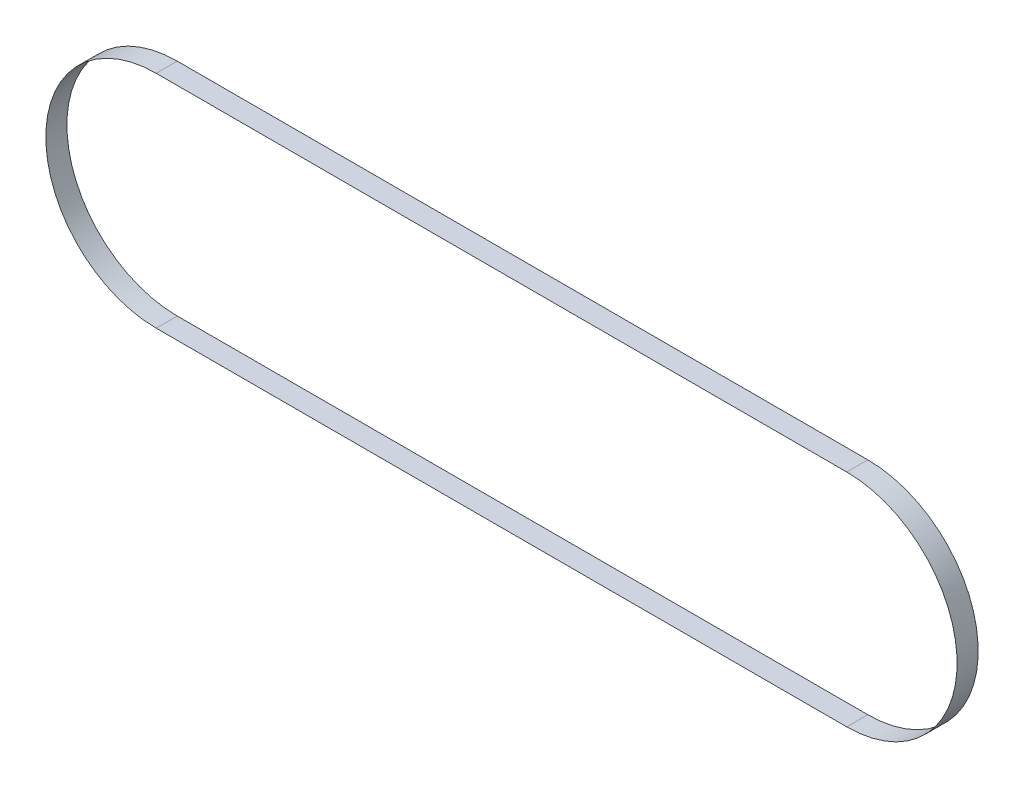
ISO-10303-21;
HEADER;
FILE_DESCRIPTION(('STEP AP214'),'2;1');
FILE_NAME('part.step','',(''),(''),'','','');
FILE_SCHEMA(('AUTOMOTIVE_DESIGN { 1 0 10303 214 1 1 1 1 }'));
ENDSEC;
DATA;
#1=APPLICATION_CONTEXT('core data for automotive mechanical design processes');
#2=APPLICATION_PROTOCOL_DEFINITION('international standard','automotive_design',2000,#1);
#3=PRODUCT_CONTEXT('',#1,'mechanical');
#4=PRODUCT('Part','Part','',(#3));
#5=PRODUCT_RELATED_PRODUCT_CATEGORY('part','',(#4));
#6=PRODUCT_DEFINITION_FORMATION('','',#4);
#7=PRODUCT_DEFINITION_CONTEXT('part definition',#1,'design');
#8=PRODUCT_DEFINITION('design','',#6,#7);
#9=PRODUCT_DEFINITION_SHAPE('','',#8);
#10=(LENGTH_UNIT() NAMED_UNIT(*) SI_UNIT(.MILLI.,.METRE.));
#11=(NAMED_UNIT(*) PLANE_ANGLE_UNIT() SI_UNIT($,.RADIAN.));
#12=(NAMED_UNIT(*) SI_UNIT($,.STERADIAN.) SOLID_ANGLE_UNIT());
#13=UNCERTAINTY_MEASURE_WITH_UNIT(LENGTH_MEASURE(1.E-05),#10,'distance_accuracy_value','');
#14=(GEOMETRIC_REPRESENTATION_CONTEXT(3) GLOBAL_UNCERTAINTY_ASSIGNED_CONTEXT((#13)) GLOBAL_UNIT_ASSIGNED_CONTEXT((#10,
#11,#12)) REPRESENTATION_CONTEXT('',''));
#15=CARTESIAN_POINT('',(0.,0.,0.));
#16=DIRECTION('',(0.,0.,1.));
#17=DIRECTION('',(1.,0.,0.));
#18=AXIS2_PLACEMENT_3D('',#15,#16,#17);
#19=CARTESIAN_POINT('',(253.982046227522,0.,3.875));
#20=DIRECTION('',(0.,0.,-1.));
#21=DIRECTION('',(-1.,0.,0.));
#22=AXIS2_PLACEMENT_3D('',#19,#20,#21);
#23=PLANE('',#22);
#24=CARTESIAN_POINT('',(253.982046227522,0.,3.875));
#25=DIRECTION('',(0.,0.,-1.));
#26=DIRECTION('',(-1.,0.,0.));
#27=AXIS2_PLACEMENT_3D('',#24,#25,#26);
#28=CIRCLE('',#27,40.59505);
#29=CARTESIAN_POINT('',(253.982046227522,-40.59505,3.875));
#30=VERTEX_POINT('',#29);
#31=CARTESIAN_POINT('',(253.982046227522,40.59505,3.875));
#32=VERTEX_POINT('',#31);
#33=EDGE_CURVE('E158',#30,#32,#28,.F.);
#34=ORIENTED_EDGE('',*,*,#33,.T.);
#35=DIRECTION('',(-1.,0.,0.));
#36=VECTOR('',#35,1.);
#37=CARTESIAN_POINT('',(253.982046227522,40.59505,3.875));
#38=LINE('',#37,#36);
#39=CARTESIAN_POINT('',(0.,40.59505,3.875));
#40=VERTEX_POINT('',#39);
#41=EDGE_CURVE('E161',#32,#40,#38,.T.);
#42=ORIENTED_EDGE('',*,*,#41,.T.);
#43=CARTESIAN_POINT('',(0.,0.,3.875));
#44=DIRECTION('',(0.,0.,-1.));
#45=DIRECTION('',(-1.,0.,0.));
#46=AXIS2_PLACEMENT_3D('',#43,#44,#45);
#47=CIRCLE('',#46,40.59505);
#48=CARTESIAN_POINT('',(0.,-40.59505,3.875));
#49=VERTEX_POINT('',#48);
#50=EDGE_CURVE('E164',#40,#49,#47,.F.);
#51=ORIENTED_EDGE('',*,*,#50,.T.);
#52=DIRECTION('',(1.,0.,0.));
#53=VECTOR('',#52,1.);
#54=CARTESIAN_POINT('',(253.982046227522,-40.59505,3.875));
#55=LINE('',#54,#53);
#56=EDGE_CURVE('E166',#49,#30,#55,.T.);
#57=ORIENTED_EDGE('',*,*,#56,.T.);
#58=EDGE_LOOP('',(#34,#42,#51,#57));
#59=FACE_BOUND('',#58,.T.);
#60=CARTESIAN_POINT('',(253.982046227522,0.,3.875));
#61=DIRECTION('',(0.,0.,-1.));
#62=DIRECTION('',(-1.,0.,0.));
#63=AXIS2_PLACEMENT_3D('',#60,#61,#62);
#64=CIRCLE('',#63,40.59495);
#65=CARTESIAN_POINT('',(253.982046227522,-40.59495,3.875));
#66=VERTEX_POINT('',#65);
#67=CARTESIAN_POINT('',(253.982046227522,40.59495,3.875));
#68=VERTEX_POINT('',#67);
#69=EDGE_CURVE('E122',#66,#68,#64,.F.);
#70=ORIENTED_EDGE('',*,*,#69,.F.);
#71=DIRECTION('',(1.,0.,0.));
#72=VECTOR('',#71,1.);
#73=CARTESIAN_POINT('',(253.982046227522,-40.59495,3.875));
#74=LINE('',#73,#72);
#75=CARTESIAN_POINT('',(0.,-40.59495,3.875));
#76=VERTEX_POINT('',#75);
#77=EDGE_CURVE('E144',#76,#66,#74,.T.);
#78=ORIENTED_EDGE('',*,*,#77,.F.);
#79=CARTESIAN_POINT('',(0.,0.,3.875));
#80=DIRECTION('',(0.,0.,-1.));
#81=DIRECTION('',(-1.,0.,0.));
#82=AXIS2_PLACEMENT_3D('',#79,#80,#81);
#83=CIRCLE('',#82,40.59495);
#84=CARTESIAN_POINT('',(0.,40.59495,3.875));
#85=VERTEX_POINT('',#84);
#86=EDGE_CURVE('E142',#85,#76,#83,.F.);
#87=ORIENTED_EDGE('',*,*,#86,.F.);
#88=DIRECTION('',(-1.,0.,0.));
#89=VECTOR('',#88,1.);
#90=CARTESIAN_POINT('',(253.982046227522,40.59495,3.875));
#91=LINE('',#90,#89);
#92=EDGE_CURVE('E130',#68,#85,#91,.T.);
#93=ORIENTED_EDGE('',*,*,#92,.F.);
#94=EDGE_LOOP('',(#70,#78,#87,#93));
#95=FACE_BOUND('',#94,.T.);
#96=ADVANCED_FACE('F57',(#59,#95),#23,.F.);
#97=CARTESIAN_POINT('',(253.982046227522,0.,-3.875));
#98=DIRECTION('',(0.,0.,-1.));
#99=DIRECTION('',(-1.,0.,0.));
#100=AXIS2_PLACEMENT_3D('',#97,#98,#99);
#101=PLANE('',#100);
#102=CARTESIAN_POINT('',(253.982046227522,0.,-3.875));
#103=DIRECTION('',(0.,0.,-1.));
#104=DIRECTION('',(-1.,0.,0.));
#105=AXIS2_PLACEMENT_3D('',#102,#103,#104);
#106=CIRCLE('',#105,40.59505);
#107=CARTESIAN_POINT('',(253.982046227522,-40.59505,-3.875));
#108=VERTEX_POINT('',#107);
#109=CARTESIAN_POINT('',(253.982046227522,40.59505,-3.875));
#110=VERTEX_POINT('',#109);
#111=EDGE_CURVE('E138',#108,#110,#106,.F.);
#112=ORIENTED_EDGE('',*,*,#111,.F.);
#113=DIRECTION('',(1.,0.,0.));
#114=VECTOR('',#113,1.);
#115=CARTESIAN_POINT('',(253.982046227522,-40.59505,-3.875));
#116=LINE('',#115,#114);
#117=CARTESIAN_POINT('',(0.,-40.59505,-3.875));
#118=VERTEX_POINT('',#117);
#119=EDGE_CURVE('E162',#118,#108,#116,.T.);
#120=ORIENTED_EDGE('',*,*,#119,.F.);
#121=CARTESIAN_POINT('',(0.,0.,-3.875));
#122=DIRECTION('',(0.,0.,-1.));
#123=DIRECTION('',(-1.,0.,0.));
#124=AXIS2_PLACEMENT_3D('',#121,#122,#123);
#125=CIRCLE('',#124,40.59505);
#126=CARTESIAN_POINT('',(0.,40.59505,-3.875));
#127=VERTEX_POINT('',#126);
#128=EDGE_CURVE('E173',#127,#118,#125,.F.);
#129=ORIENTED_EDGE('',*,*,#128,.F.);
#130=DIRECTION('',(-1.,0.,0.));
#131=VECTOR('',#130,1.);
#132=CARTESIAN_POINT('',(253.982046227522,40.59505,-3.875));
#133=LINE('',#132,#131);
#134=EDGE_CURVE('E171',#110,#127,#133,.T.);
#135=ORIENTED_EDGE('',*,*,#134,.F.);
#136=EDGE_LOOP('',(#112,#120,#129,#135));
#137=FACE_BOUND('',#136,.T.);
#138=DIRECTION('',(1.,0.,0.));
#139=VECTOR('',#138,1.);
#140=CARTESIAN_POINT('',(253.982046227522,-40.59495,-3.875));
#141=LINE('',#140,#139);
#142=CARTESIAN_POINT('',(0.,-40.59495,-3.875));
#143=VERTEX_POINT('',#142);
#144=CARTESIAN_POINT('',(253.982046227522,-40.59495,-3.875));
#145=VERTEX_POINT('',#144);
#146=EDGE_CURVE('E131',#143,#145,#141,.T.);
#147=ORIENTED_EDGE('',*,*,#146,.T.);
#148=CARTESIAN_POINT('',(253.982046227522,0.,-3.875));
#149=DIRECTION('',(0.,0.,-1.));
#150=DIRECTION('',(-1.,0.,0.));
#151=AXIS2_PLACEMENT_3D('',#148,#149,#150);
#152=CIRCLE('',#151,40.59495);
#153=CARTESIAN_POINT('',(253.982046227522,40.59495,-3.875));
#154=VERTEX_POINT('',#153);
#155=EDGE_CURVE('E80',#145,#154,#152,.F.);
#156=ORIENTED_EDGE('',*,*,#155,.T.);
#157=DIRECTION('',(-1.,0.,0.));
#158=VECTOR('',#157,1.);
#159=CARTESIAN_POINT('',(253.982046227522,40.59495,-3.875));
#160=LINE('',#159,#158);
#161=CARTESIAN_POINT('',(0.,40.59495,-3.875));
#162=VERTEX_POINT('',#161);
#163=EDGE_CURVE('E137',#154,#162,#160,.T.);
#164=ORIENTED_EDGE('',*,*,#163,.T.);
#165=CARTESIAN_POINT('',(0.,0.,-3.875));
#166=DIRECTION('',(0.,0.,-1.));
#167=DIRECTION('',(-1.,0.,0.));
#168=AXIS2_PLACEMENT_3D('',#165,#166,#167);
#169=CIRCLE('',#168,40.59495);
#170=EDGE_CURVE('E150',#162,#143,#169,.F.);
#171=ORIENTED_EDGE('',*,*,#170,.T.);
#172=EDGE_LOOP('',(#147,#156,#164,#171));
#173=FACE_BOUND('',#172,.T.);
#174=ADVANCED_FACE('F191',(#137,#173),#101,.T.);
#175=CARTESIAN_POINT('',(253.982046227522,0.,3.875));
#176=DIRECTION('',(0.,0.,-1.));
#177=DIRECTION('',(-1.,0.,0.));
#178=AXIS2_PLACEMENT_3D('',#175,#176,#177);
#179=CYLINDRICAL_SURFACE('',#178,40.59505);
#180=ORIENTED_EDGE('',*,*,#111,.T.);
#181=DIRECTION('',(0.,0.,-1.));
#182=VECTOR('',#181,1.);
#183=CARTESIAN_POINT('',(253.982046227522,40.59505,3.875));
#184=LINE('',#183,#182);
#185=EDGE_CURVE('E12',#32,#110,#184,.T.);
#186=ORIENTED_EDGE('',*,*,#185,.F.);
#187=ORIENTED_EDGE('',*,*,#33,.F.);
#188=DIRECTION('',(0.,0.,-1.));
#189=VECTOR('',#188,1.);
#190=CARTESIAN_POINT('',(253.982046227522,-40.59505,3.875));
#191=LINE('',#190,#189);
#192=EDGE_CURVE('E168',#30,#108,#191,.T.);
#193=ORIENTED_EDGE('',*,*,#192,.T.);
#194=EDGE_LOOP('',(#180,#186,#187,#193));
#195=FACE_BOUND('',#194,.T.);
#196=ADVANCED_FACE('F59',(#195),#179,.T.);
#197=CARTESIAN_POINT('',(253.982046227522,40.59505,3.875));
#198=DIRECTION('',(0.,-1.,0.));
#199=DIRECTION('',(1.,0.,0.));
#200=AXIS2_PLACEMENT_3D('',#197,#198,#199);
#201=PLANE('',#200);
#202=ORIENTED_EDGE('',*,*,#134,.T.);
#203=DIRECTION('',(0.,0.,-1.));
#204=VECTOR('',#203,1.);
#205=CARTESIAN_POINT('',(0.,40.59505,3.875));
#206=LINE('',#205,#204);
#207=EDGE_CURVE('E65',#40,#127,#206,.T.);
#208=ORIENTED_EDGE('',*,*,#207,.F.);
#209=ORIENTED_EDGE('',*,*,#41,.F.);
#210=ORIENTED_EDGE('',*,*,#185,.T.);
#211=EDGE_LOOP('',(#202,#208,#209,#210));
#212=FACE_BOUND('',#211,.T.);
#213=ADVANCED_FACE('F201',(#212),#201,.F.);
#214=CARTESIAN_POINT('',(0.,0.,3.875));
#215=DIRECTION('',(0.,0.,-1.));
#216=DIRECTION('',(-1.,0.,0.));
#217=AXIS2_PLACEMENT_3D('',#214,#215,#216);
#218=CYLINDRICAL_SURFACE('',#217,40.59505);
#219=ORIENTED_EDGE('',*,*,#128,.T.);
#220=DIRECTION('',(0.,0.,-1.));
#221=VECTOR('',#220,1.);
#222=CARTESIAN_POINT('',(0.,-40.59505,3.875));
#223=LINE('',#222,#221);
#224=EDGE_CURVE('E178',#49,#118,#223,.T.);
#225=ORIENTED_EDGE('',*,*,#224,.F.);
#226=ORIENTED_EDGE('',*,*,#50,.F.);
#227=ORIENTED_EDGE('',*,*,#207,.T.);
#228=EDGE_LOOP('',(#219,#225,#226,#227));
#229=FACE_BOUND('',#228,.T.);
#230=ADVANCED_FACE('F185',(#229),#218,.T.);
#231=CARTESIAN_POINT('',(253.982046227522,-40.59505,3.875));
#232=DIRECTION('',(0.,1.,0.));
#233=DIRECTION('',(-1.,0.,0.));
#234=AXIS2_PLACEMENT_3D('',#231,#232,#233);
#235=PLANE('',#234);
#236=ORIENTED_EDGE('',*,*,#119,.T.);
#237=ORIENTED_EDGE('',*,*,#192,.F.);
#238=ORIENTED_EDGE('',*,*,#56,.F.);
#239=ORIENTED_EDGE('',*,*,#224,.T.);
#240=EDGE_LOOP('',(#236,#237,#238,#239));
#241=FACE_BOUND('',#240,.T.);
#242=ADVANCED_FACE('F195',(#241),#235,.F.);
#243=CARTESIAN_POINT('',(253.982046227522,0.,3.875));
#244=DIRECTION('',(0.,0.,-1.));
#245=DIRECTION('',(-1.,0.,0.));
#246=AXIS2_PLACEMENT_3D('',#243,#244,#245);
#247=CYLINDRICAL_SURFACE('',#246,40.59495);
#248=ORIENTED_EDGE('',*,*,#155,.F.);
#249=DIRECTION('',(0.,0.,-1.));
#250=VECTOR('',#249,1.);
#251=CARTESIAN_POINT('',(253.982046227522,-40.59495,3.875));
#252=LINE('',#251,#250);
#253=EDGE_CURVE('E126',#66,#145,#252,.T.);
#254=ORIENTED_EDGE('',*,*,#253,.F.);
#255=ORIENTED_EDGE('',*,*,#69,.T.);
#256=DIRECTION('',(0.,0.,-1.));
#257=VECTOR('',#256,1.);
#258=CARTESIAN_POINT('',(253.982046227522,40.59495,3.875));
#259=LINE('',#258,#257);
#260=EDGE_CURVE('E125',#68,#154,#259,.T.);
#261=ORIENTED_EDGE('',*,*,#260,.T.);
#262=EDGE_LOOP('',(#248,#254,#255,#261));
#263=FACE_BOUND('',#262,.T.);
#264=ADVANCED_FACE('F124',(#263),#247,.F.);
#265=CARTESIAN_POINT('',(253.982046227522,40.59495,3.875));
#266=DIRECTION('',(0.,-1.,0.));
#267=DIRECTION('',(1.,0.,0.));
#268=AXIS2_PLACEMENT_3D('',#265,#266,#267);
#269=PLANE('',#268);
#270=ORIENTED_EDGE('',*,*,#163,.F.);
#271=ORIENTED_EDGE('',*,*,#260,.F.);
#272=ORIENTED_EDGE('',*,*,#92,.T.);
#273=DIRECTION('',(0.,0.,-1.));
#274=VECTOR('',#273,1.);
#275=CARTESIAN_POINT('',(0.,40.59495,3.875));
#276=LINE('',#275,#274);
#277=EDGE_CURVE('E139',#85,#162,#276,.T.);
#278=ORIENTED_EDGE('',*,*,#277,.T.);
#279=EDGE_LOOP('',(#270,#271,#272,#278));
#280=FACE_BOUND('',#279,.T.);
#281=ADVANCED_FACE('F134',(#280),#269,.T.);
#282=CARTESIAN_POINT('',(0.,0.,3.875));
#283=DIRECTION('',(0.,0.,-1.));
#284=DIRECTION('',(-1.,0.,0.));
#285=AXIS2_PLACEMENT_3D('',#282,#283,#284);
#286=CYLINDRICAL_SURFACE('',#285,40.59495);
#287=ORIENTED_EDGE('',*,*,#170,.F.);
#288=ORIENTED_EDGE('',*,*,#277,.F.);
#289=ORIENTED_EDGE('',*,*,#86,.T.);
#290=DIRECTION('',(0.,0.,-1.));
#291=VECTOR('',#290,1.);
#292=CARTESIAN_POINT('',(0.,-40.59495,3.875));
#293=LINE('',#292,#291);
#294=EDGE_CURVE('E72',#76,#143,#293,.T.);
#295=ORIENTED_EDGE('',*,*,#294,.T.);
#296=EDGE_LOOP('',(#287,#288,#289,#295));
#297=FACE_BOUND('',#296,.T.);
#298=ADVANCED_FACE('F224',(#297),#286,.F.);
#299=CARTESIAN_POINT('',(253.982046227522,-40.59495,3.875));
#300=DIRECTION('',(0.,1.,0.));
#301=DIRECTION('',(-1.,0.,0.));
#302=AXIS2_PLACEMENT_3D('',#299,#300,#301);
#303=PLANE('',#302);
#304=ORIENTED_EDGE('',*,*,#146,.F.);
#305=ORIENTED_EDGE('',*,*,#294,.F.);
#306=ORIENTED_EDGE('',*,*,#77,.T.);
#307=ORIENTED_EDGE('',*,*,#253,.T.);
#308=EDGE_LOOP('',(#304,#305,#306,#307));
#309=FACE_BOUND('',#308,.T.);
#310=ADVANCED_FACE('F228',(#309),#303,.T.);
#311=CLOSED_SHELL('',(#96,#174,#196,#213,#230,#242,#264,#281,#298,#310));
#312=MANIFOLD_SOLID_BREP('B2',#311);
#313=ADVANCED_BREP_SHAPE_REPRESENTATION('',(#18,#312),#14);
#314=SHAPE_DEFINITION_REPRESENTATION(#9,#313);
ENDSEC;
END-ISO-10303-21;
